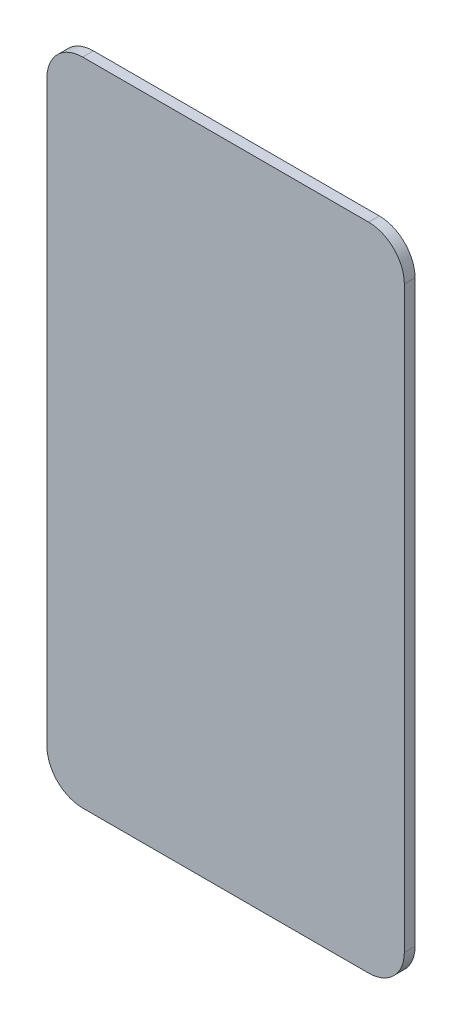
from build123d import *

# Parameters (mm, degrees)
EXTRUSION1_DEPTH = 3


with BuildPart() as part:
    # Esquisse1 → Extrusion1 (new body)
    with BuildSketch(Plane.XY):
        with BuildLine():
            Line((-40, 91), (40, 91))
            ThreePointArc((40, 91), (47.071067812, 88.071067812), (50, 81))
            Line((50, 81), (50, -81))
            ThreePointArc((50, -81), (47.071067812, -88.071067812), (40, -91))
            Line((40, -91), (-40, -91))
            ThreePointArc((-40, -91), (-47.071067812, -88.071067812), (-50, -81))
            Line((-50, -81), (-50, 81))
            ThreePointArc((-50, 81), (-47.071067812, 88.071067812), (-40, 91))
        make_face()
    extrude(amount=EXTRUSION1_DEPTH)


solid = part.part
